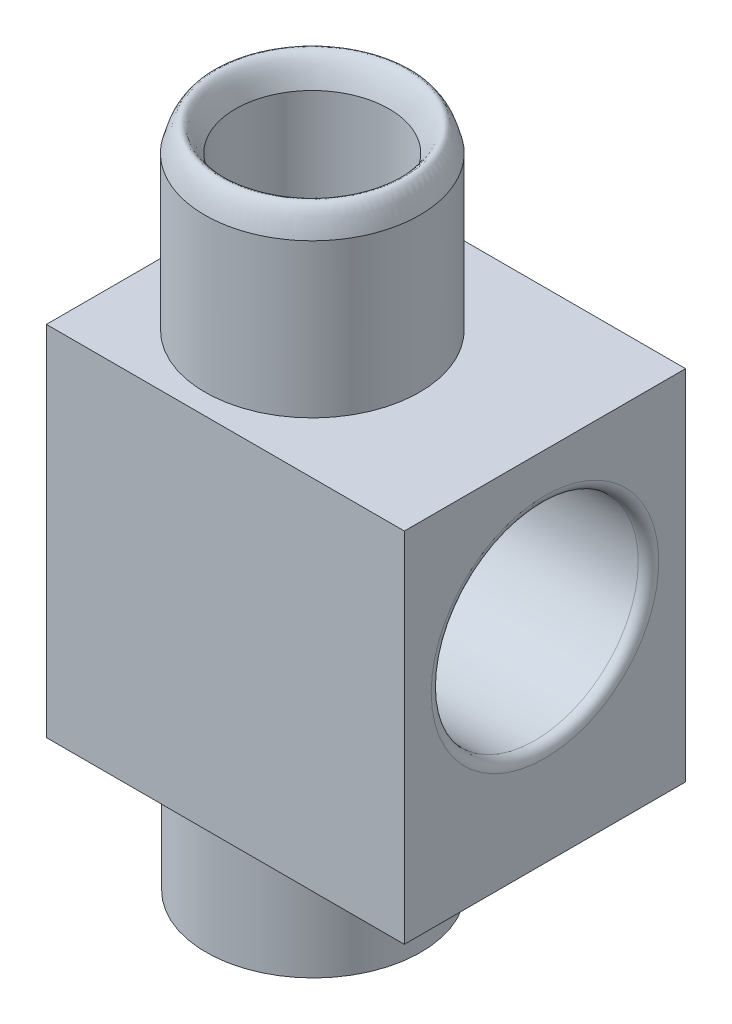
ISO-10303-21;
HEADER;
FILE_DESCRIPTION(('STEP AP214'),'2;1');
FILE_NAME('part.step','',(''),(''),'','','');
FILE_SCHEMA(('AUTOMOTIVE_DESIGN { 1 0 10303 214 1 1 1 1 }'));
ENDSEC;
DATA;
#1=APPLICATION_CONTEXT('core data for automotive mechanical design processes');
#2=APPLICATION_PROTOCOL_DEFINITION('international standard','automotive_design',2000,#1);
#3=PRODUCT_CONTEXT('',#1,'mechanical');
#4=PRODUCT('Part','Part','',(#3));
#5=PRODUCT_RELATED_PRODUCT_CATEGORY('part','',(#4));
#6=PRODUCT_DEFINITION_FORMATION('','',#4);
#7=PRODUCT_DEFINITION_CONTEXT('part definition',#1,'design');
#8=PRODUCT_DEFINITION('design','',#6,#7);
#9=PRODUCT_DEFINITION_SHAPE('','',#8);
#10=(LENGTH_UNIT() NAMED_UNIT(*) SI_UNIT(.MILLI.,.METRE.));
#11=(NAMED_UNIT(*) PLANE_ANGLE_UNIT() SI_UNIT($,.RADIAN.));
#12=(NAMED_UNIT(*) SI_UNIT($,.STERADIAN.) SOLID_ANGLE_UNIT());
#13=UNCERTAINTY_MEASURE_WITH_UNIT(LENGTH_MEASURE(1.E-05),#10,'distance_accuracy_value','');
#14=(GEOMETRIC_REPRESENTATION_CONTEXT(3) GLOBAL_UNCERTAINTY_ASSIGNED_CONTEXT((#13)) GLOBAL_UNIT_ASSIGNED_CONTEXT((#10,
#11,#12)) REPRESENTATION_CONTEXT('',''));
#15=CARTESIAN_POINT('',(0.,0.,0.));
#16=DIRECTION('',(0.,0.,1.));
#17=DIRECTION('',(1.,0.,0.));
#18=AXIS2_PLACEMENT_3D('',#15,#16,#17);
#19=CARTESIAN_POINT('',(0.,0.,-13.97));
#20=DIRECTION('',(0.,-1.,0.));
#21=DIRECTION('',(0.,0.,-1.));
#22=AXIS2_PLACEMENT_3D('',#19,#20,#21);
#23=PLANE('',#22);
#24=DIRECTION('',(0.,0.,1.));
#25=VECTOR('',#24,1.);
#26=CARTESIAN_POINT('',(0.,0.,0.));
#27=LINE('',#26,#25);
#28=CARTESIAN_POINT('',(0.,0.,-13.97));
#29=VERTEX_POINT('',#28);
#30=CARTESIAN_POINT('',(0.,0.,0.));
#31=VERTEX_POINT('',#30);
#32=EDGE_CURVE('E152',#29,#31,#27,.T.);
#33=ORIENTED_EDGE('',*,*,#32,.F.);
#34=DIRECTION('',(-1.,0.,0.));
#35=VECTOR('',#34,1.);
#36=CARTESIAN_POINT('',(0.,0.,-13.97));
#37=LINE('',#36,#35);
#38=CARTESIAN_POINT('',(17.78,0.,-13.97));
#39=VERTEX_POINT('',#38);
#40=EDGE_CURVE('E123',#39,#29,#37,.T.);
#41=ORIENTED_EDGE('',*,*,#40,.F.);
#42=DIRECTION('',(0.,0.,-1.));
#43=VECTOR('',#42,1.);
#44=CARTESIAN_POINT('',(17.78,0.,0.));
#45=LINE('',#44,#43);
#46=CARTESIAN_POINT('',(17.78,0.,0.));
#47=VERTEX_POINT('',#46);
#48=EDGE_CURVE('E117',#47,#39,#45,.T.);
#49=ORIENTED_EDGE('',*,*,#48,.F.);
#50=DIRECTION('',(1.,0.,0.));
#51=VECTOR('',#50,1.);
#52=CARTESIAN_POINT('',(0.,0.,0.));
#53=LINE('',#52,#51);
#54=EDGE_CURVE('E142',#31,#47,#53,.T.);
#55=ORIENTED_EDGE('',*,*,#54,.F.);
#56=EDGE_LOOP('',(#33,#41,#49,#55));
#57=FACE_BOUND('',#56,.T.);
#58=CARTESIAN_POINT('',(6.84958993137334,0.,-6.41337171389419));
#59=DIRECTION('',(0.,-1.,0.));
#60=DIRECTION('',(0.,0.,-1.));
#61=AXIS2_PLACEMENT_3D('',#58,#59,#60);
#62=CIRCLE('',#61,5.334);
#63=CARTESIAN_POINT('',(6.84958993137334,0.,-11.7473717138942));
#64=VERTEX_POINT('',#63);
#65=EDGE_CURVE('E250',#64,#64,#62,.T.);
#66=ORIENTED_EDGE('',*,*,#65,.F.);
#67=EDGE_LOOP('',(#66));
#68=FACE_BOUND('',#67,.T.);
#69=ADVANCED_FACE('F83',(#57,#68),#23,.T.);
#70=CARTESIAN_POINT('',(0.,17.78,-13.97));
#71=DIRECTION('',(0.,-1.,0.));
#72=DIRECTION('',(0.,0.,-1.));
#73=AXIS2_PLACEMENT_3D('',#70,#71,#72);
#74=PLANE('',#73);
#75=DIRECTION('',(0.,0.,1.));
#76=VECTOR('',#75,1.);
#77=CARTESIAN_POINT('',(0.,17.78,0.));
#78=LINE('',#77,#76);
#79=CARTESIAN_POINT('',(0.,17.78,-13.97));
#80=VERTEX_POINT('',#79);
#81=CARTESIAN_POINT('',(0.,17.78,0.));
#82=VERTEX_POINT('',#81);
#83=EDGE_CURVE('E137',#80,#82,#78,.T.);
#84=ORIENTED_EDGE('',*,*,#83,.T.);
#85=DIRECTION('',(1.,0.,0.));
#86=VECTOR('',#85,1.);
#87=CARTESIAN_POINT('',(0.,17.78,0.));
#88=LINE('',#87,#86);
#89=CARTESIAN_POINT('',(17.78,17.78,0.));
#90=VERTEX_POINT('',#89);
#91=EDGE_CURVE('E131',#82,#90,#88,.T.);
#92=ORIENTED_EDGE('',*,*,#91,.T.);
#93=DIRECTION('',(0.,0.,-1.));
#94=VECTOR('',#93,1.);
#95=CARTESIAN_POINT('',(17.78,17.78,0.));
#96=LINE('',#95,#94);
#97=CARTESIAN_POINT('',(17.78,17.78,-13.97));
#98=VERTEX_POINT('',#97);
#99=EDGE_CURVE('E135',#90,#98,#96,.T.);
#100=ORIENTED_EDGE('',*,*,#99,.T.);
#101=DIRECTION('',(-1.,0.,0.));
#102=VECTOR('',#101,1.);
#103=CARTESIAN_POINT('',(0.,17.78,-13.97));
#104=LINE('',#103,#102);
#105=EDGE_CURVE('E100',#98,#80,#104,.T.);
#106=ORIENTED_EDGE('',*,*,#105,.T.);
#107=EDGE_LOOP('',(#84,#92,#100,#106));
#108=FACE_BOUND('',#107,.T.);
#109=CARTESIAN_POINT('',(6.858,17.78,-6.35));
#110=DIRECTION('',(0.,-1.,0.));
#111=DIRECTION('',(0.,0.,-1.));
#112=AXIS2_PLACEMENT_3D('',#109,#110,#111);
#113=CIRCLE('',#112,5.334);
#114=CARTESIAN_POINT('',(6.858,17.78,-11.684));
#115=VERTEX_POINT('',#114);
#116=EDGE_CURVE('E162',#115,#115,#113,.F.);
#117=ORIENTED_EDGE('',*,*,#116,.F.);
#118=EDGE_LOOP('',(#117));
#119=FACE_BOUND('',#118,.T.);
#120=ADVANCED_FACE('F132',(#108,#119),#74,.F.);
#121=CARTESIAN_POINT('',(0.,17.78,0.));
#122=DIRECTION('',(1.,0.,0.));
#123=DIRECTION('',(0.,0.,-1.));
#124=AXIS2_PLACEMENT_3D('',#121,#122,#123);
#125=PLANE('',#124);
#126=ORIENTED_EDGE('',*,*,#32,.T.);
#127=DIRECTION('',(0.,-1.,0.));
#128=VECTOR('',#127,1.);
#129=CARTESIAN_POINT('',(0.,17.78,0.));
#130=LINE('',#129,#128);
#131=EDGE_CURVE('E143',#82,#31,#130,.T.);
#132=ORIENTED_EDGE('',*,*,#131,.F.);
#133=ORIENTED_EDGE('',*,*,#83,.F.);
#134=DIRECTION('',(0.,-1.,0.));
#135=VECTOR('',#134,1.);
#136=CARTESIAN_POINT('',(0.,17.78,-13.97));
#137=LINE('',#136,#135);
#138=EDGE_CURVE('E148',#80,#29,#137,.T.);
#139=ORIENTED_EDGE('',*,*,#138,.T.);
#140=EDGE_LOOP('',(#126,#132,#133,#139));
#141=FACE_BOUND('',#140,.T.);
#142=ADVANCED_FACE('F209',(#141),#125,.F.);
#143=CARTESIAN_POINT('',(0.,17.78,0.));
#144=DIRECTION('',(0.,0.,-1.));
#145=DIRECTION('',(-1.,0.,0.));
#146=AXIS2_PLACEMENT_3D('',#143,#144,#145);
#147=PLANE('',#146);
#148=ORIENTED_EDGE('',*,*,#54,.T.);
#149=DIRECTION('',(0.,-1.,0.));
#150=VECTOR('',#149,1.);
#151=CARTESIAN_POINT('',(17.78,17.78,0.));
#152=LINE('',#151,#150);
#153=EDGE_CURVE('E140',#90,#47,#152,.T.);
#154=ORIENTED_EDGE('',*,*,#153,.F.);
#155=ORIENTED_EDGE('',*,*,#91,.F.);
#156=ORIENTED_EDGE('',*,*,#131,.T.);
#157=EDGE_LOOP('',(#148,#154,#155,#156));
#158=FACE_BOUND('',#157,.T.);
#159=ADVANCED_FACE('F141',(#158),#147,.F.);
#160=CARTESIAN_POINT('',(17.78,17.78,0.));
#161=DIRECTION('',(-1.,0.,0.));
#162=DIRECTION('',(0.,0.,1.));
#163=AXIS2_PLACEMENT_3D('',#160,#161,#162);
#164=PLANE('',#163);
#165=CARTESIAN_POINT('',(17.78,10.16,-6.985));
#166=DIRECTION('',(-1.,0.,0.));
#167=DIRECTION('',(0.,0.,1.));
#168=AXIS2_PLACEMENT_3D('',#165,#166,#167);
#169=CIRCLE('',#168,5.6515);
#170=CARTESIAN_POINT('',(17.78,10.16,-1.3335));
#171=VERTEX_POINT('',#170);
#172=EDGE_CURVE('E14',#171,#171,#169,.T.);
#173=ORIENTED_EDGE('',*,*,#172,.T.);
#174=EDGE_LOOP('',(#173));
#175=FACE_BOUND('',#174,.T.);
#176=ORIENTED_EDGE('',*,*,#48,.T.);
#177=DIRECTION('',(0.,-1.,0.));
#178=VECTOR('',#177,1.);
#179=CARTESIAN_POINT('',(17.78,17.78,-13.97));
#180=LINE('',#179,#178);
#181=EDGE_CURVE('E144',#98,#39,#180,.T.);
#182=ORIENTED_EDGE('',*,*,#181,.F.);
#183=ORIENTED_EDGE('',*,*,#99,.F.);
#184=ORIENTED_EDGE('',*,*,#153,.T.);
#185=EDGE_LOOP('',(#176,#182,#183,#184));
#186=FACE_BOUND('',#185,.T.);
#187=ADVANCED_FACE('F146',(#175,#186),#164,.F.);
#188=CARTESIAN_POINT('',(0.,17.78,-13.97));
#189=DIRECTION('',(0.,0.,1.));
#190=DIRECTION('',(1.,0.,0.));
#191=AXIS2_PLACEMENT_3D('',#188,#189,#190);
#192=PLANE('',#191);
#193=ORIENTED_EDGE('',*,*,#40,.T.);
#194=ORIENTED_EDGE('',*,*,#138,.F.);
#195=ORIENTED_EDGE('',*,*,#105,.F.);
#196=ORIENTED_EDGE('',*,*,#181,.T.);
#197=EDGE_LOOP('',(#193,#194,#195,#196));
#198=FACE_BOUND('',#197,.T.);
#199=ADVANCED_FACE('F236',(#198),#192,.F.);
#200=CARTESIAN_POINT('',(6.858,25.4,-6.35));
#201=DIRECTION('',(0.,-1.,0.));
#202=DIRECTION('',(0.,0.,-1.));
#203=AXIS2_PLACEMENT_3D('',#200,#201,#202);
#204=CYLINDRICAL_SURFACE('',#203,5.334);
#205=CARTESIAN_POINT('',(6.85800000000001,25.3999979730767,-1.01600793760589));
#206=CARTESIAN_POINT('',(6.94538554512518,25.3999828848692,-1.01600219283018));
#207=CARTESIAN_POINT('',(7.03277230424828,25.3999267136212,-1.01813716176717));
#208=CARTESIAN_POINT('',(7.2071225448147,25.3998209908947,-1.02668726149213));
#209=CARTESIAN_POINT('',(7.29408653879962,25.3997714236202,-1.03309195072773));
#210=CARTESIAN_POINT('',(7.46759150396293,25.399766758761,-1.05017994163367));
#211=CARTESIAN_POINT('',(7.55413248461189,25.3998116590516,-1.06086314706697));
#212=CARTESIAN_POINT('',(7.72679170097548,25.3999283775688,-1.08649511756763));
#213=CARTESIAN_POINT('',(7.81290842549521,25.4000002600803,-1.1014540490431));
#214=CARTESIAN_POINT('',(7.98430797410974,25.3999948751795,-1.13554658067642));
#215=CARTESIAN_POINT('',(8.06959083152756,25.399917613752,-1.15468001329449));
#216=CARTESIAN_POINT('',(8.23891159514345,25.3997962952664,-1.19707122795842));
#217=CARTESIAN_POINT('',(8.32295196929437,25.3997521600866,-1.22031914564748));
#218=CARTESIAN_POINT('',(8.48978921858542,25.399755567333,-1.2709290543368));
#219=CARTESIAN_POINT('',(8.57258603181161,25.3998031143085,-1.29829124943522));
#220=CARTESIAN_POINT('',(8.73693883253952,25.3999247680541,-1.35711912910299));
#221=CARTESIAN_POINT('',(8.81849124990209,25.3999989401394,-1.38859478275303));
#222=CARTESIAN_POINT('',(8.97995534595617,25.3999952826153,-1.4554744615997));
#223=CARTESIAN_POINT('',(9.05986725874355,25.3999174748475,-1.49087792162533));
#224=CARTESIAN_POINT('',(9.21766514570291,25.399795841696,-1.56548714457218));
#225=CARTESIAN_POINT('',(9.2955554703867,25.3997519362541,-1.6046837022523));
#226=CARTESIAN_POINT('',(9.44931369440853,25.3997556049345,-1.68686908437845));
#227=CARTESIAN_POINT('',(9.52518149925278,25.3998031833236,-1.72985808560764));
#228=CARTESIAN_POINT('',(9.67489934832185,25.3999249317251,-1.81961855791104));
#229=CARTESIAN_POINT('',(9.7487439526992,25.3999991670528,-1.86639909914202));
#230=CARTESIAN_POINT('',(9.89405791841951,25.3999956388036,-1.96349325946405));
#231=CARTESIAN_POINT('',(9.96552760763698,25.3999178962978,-2.01380638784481));
#232=CARTESIAN_POINT('',(10.105738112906,25.3997963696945,-2.11776671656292));
#233=CARTESIAN_POINT('',(10.174484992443,25.3997525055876,-2.17140573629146));
#234=CARTESIAN_POINT('',(10.3092552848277,25.3997561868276,-2.28200868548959));
#235=CARTESIAN_POINT('',(10.3752785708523,25.3998037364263,-2.33897276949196));
#236=CARTESIAN_POINT('',(10.504608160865,25.3999253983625,-2.45621715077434));
#237=CARTESIAN_POINT('',(10.5679073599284,25.3999995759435,-2.51650528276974));
#238=CARTESIAN_POINT('',(10.6914865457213,25.3999959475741,-2.64008313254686));
#239=CARTESIAN_POINT('',(10.7517669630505,25.3999181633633,-2.70337241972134));
#240=CARTESIAN_POINT('',(10.8690010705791,25.399796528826,-2.83268880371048));
#241=CARTESIAN_POINT('',(10.9259622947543,25.399752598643,-2.8987090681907));
#242=CARTESIAN_POINT('',(11.0365651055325,25.399756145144,-3.03347947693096));
#243=CARTESIAN_POINT('',(11.090206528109,25.3998036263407,-3.10222975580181));
#244=CARTESIAN_POINT('',(11.1941777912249,25.3999251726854,-3.24245293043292));
#245=CARTESIAN_POINT('',(11.2444991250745,25.3999993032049,-3.31393213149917));
#246=CARTESIAN_POINT('',(11.3415948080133,25.3999955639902,-3.45924504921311));
#247=CARTESIAN_POINT('',(11.3883696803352,25.3999177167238,-3.53307841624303));
#248=CARTESIAN_POINT('',(11.4781225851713,25.3997959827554,-3.6827813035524));
#249=CARTESIAN_POINT('',(11.5211093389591,25.3997520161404,-3.75864559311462));
#250=CARTESIAN_POINT('',(11.6032945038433,25.3997555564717,-3.91240393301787));
#251=CARTESIAN_POINT('',(11.6424927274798,25.399803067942,-3.99029808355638));
#252=CARTESIAN_POINT('',(11.7171101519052,25.3999247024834,-4.14811059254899));
#253=CARTESIAN_POINT('',(11.7525197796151,25.3999988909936,-4.22803347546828));
#254=CARTESIAN_POINT('',(11.8194010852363,25.3999952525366,-4.38949686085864));
#255=CARTESIAN_POINT('',(11.8508733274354,25.399917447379,-4.47103712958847));
#256=CARTESIAN_POINT('',(11.9096966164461,25.3997958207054,-4.63537375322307));
#257=CARTESIAN_POINT('',(11.9370572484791,25.3997519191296,-4.71816667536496));
#258=CARTESIAN_POINT('',(11.9876668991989,25.3997555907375,-4.88500399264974));
#259=CARTESIAN_POINT('',(12.0109157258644,25.3998031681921,-4.96904844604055));
#260=CARTESIAN_POINT('',(12.0533119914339,25.3999249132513,-5.1383851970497));
#261=CARTESIAN_POINT('',(12.0724491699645,25.399999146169,-5.22368006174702));
#262=CARTESIAN_POINT('',(12.1065457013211,25.3999956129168,-5.39508847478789));
#263=CARTESIAN_POINT('',(12.1215056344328,25.3999178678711,-5.48120190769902));
#264=CARTESIAN_POINT('',(12.1471383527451,25.3997963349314,-5.65385672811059));
#265=CARTESIAN_POINT('',(12.1578212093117,25.3997524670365,-5.74039661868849));
#266=CARTESIAN_POINT('',(12.1749100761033,25.3997561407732,-5.91390169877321));
#267=CARTESIAN_POINT('',(12.1813158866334,25.3998036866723,-6.00086690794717));
#268=CARTESIAN_POINT('',(12.1898613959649,25.3999253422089,-6.17522106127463));
#269=CARTESIAN_POINT('',(12.1919905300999,25.3999995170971,-6.26261052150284));
#270=CARTESIAN_POINT('',(12.1919914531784,25.3999958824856,-6.43737694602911));
#271=CARTESIAN_POINT('',(12.1898638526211,25.3999180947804,-6.52475391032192));
#272=CARTESIAN_POINT('',(12.1813203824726,25.3997964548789,-6.6990914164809));
#273=CARTESIAN_POINT('',(12.1749146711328,25.3997525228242,-6.78605245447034));
#274=CARTESIAN_POINT('',(12.157825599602,25.3997560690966,-6.9595575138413));
#275=CARTESIAN_POINT('',(12.1471420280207,25.3998035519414,-7.04610151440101));
#276=CARTESIAN_POINT('',(12.1215080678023,25.3999251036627,-7.21877305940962));
#277=CARTESIAN_POINT('',(12.1065472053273,25.399999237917,-7.30489904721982));
#278=CARTESIAN_POINT('',(12.0724524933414,25.3999955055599,-7.47630783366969));
#279=CARTESIAN_POINT('',(12.0533192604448,25.3999176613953,-7.56159075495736));
#280=CARTESIAN_POINT('',(12.0109282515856,25.3997959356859,-7.73091159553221));
#281=CARTESIAN_POINT('',(11.9876803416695,25.3997519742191,-7.81495198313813));
#282=CARTESIAN_POINT('',(11.9370705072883,25.3997555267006,-7.9817892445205));
#283=CARTESIAN_POINT('',(11.9097083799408,25.3998030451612,-8.06458605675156));
#284=CARTESIAN_POINT('',(11.8508806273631,25.3999246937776,-8.22893883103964));
#285=CARTESIAN_POINT('',(11.8194050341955,25.3999988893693,-8.3104912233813));
#286=CARTESIAN_POINT('',(11.7525254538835,25.3999952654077,-8.47195532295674));
#287=CARTESIAN_POINT('',(11.717122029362,25.3999174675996,-8.55186726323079));
#288=CARTESIAN_POINT('',(11.642512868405,25.3997958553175,-8.70966519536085));
#289=CARTESIAN_POINT('',(11.6033163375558,25.3997519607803,-8.78755553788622));
#290=CARTESIAN_POINT('',(11.5211310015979,25.3997556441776,-8.94131378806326));
#291=CARTESIAN_POINT('',(11.4781420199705,25.3998032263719,-9.01718160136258));
#292=CARTESIAN_POINT('',(11.3883815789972,25.3999249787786,-9.1668994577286));
#293=CARTESIAN_POINT('',(11.3416010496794,25.3999992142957,-9.24074406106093));
#294=CARTESIAN_POINT('',(11.2445069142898,25.3999956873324,-9.38605800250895));
#295=CARTESIAN_POINT('',(11.1941937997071,25.3999179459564,-9.4575276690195));
#296=CARTESIAN_POINT('',(11.0902334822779,25.3997964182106,-9.59773813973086));
#297=CARTESIAN_POINT('',(11.0365944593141,25.3997525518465,-9.66648500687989));
#298=CARTESIAN_POINT('',(10.9259914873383,25.3997562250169,-9.80125528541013));
#299=CARTESIAN_POINT('',(10.869027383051,25.3998037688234,-9.86727856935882));
#300=CARTESIAN_POINT('',(10.7517829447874,25.3999254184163,-9.99660816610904));
#301=CARTESIAN_POINT('',(10.6914947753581,25.3999995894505,-10.0599073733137));
#302=CARTESIAN_POINT('',(10.5679168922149,25.3999959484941,-10.1834865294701));
#303=CARTESIAN_POINT('',(10.5046276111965,25.3999181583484,-10.2437669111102));
#304=CARTESIAN_POINT('',(10.3753112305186,25.3997965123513,-10.3610009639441));
#305=CARTESIAN_POINT('',(10.3092909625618,25.3997525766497,-10.4179621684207));
#306=CARTESIAN_POINT('',(10.1745205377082,25.3997561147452,-10.5285649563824));
#307=CARTESIAN_POINT('',(10.1057702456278,25.3998035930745,-10.5822063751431));
#308=CARTESIAN_POINT('',(9.96554703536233,25.3999251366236,-10.6861776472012));
#309=CARTESIAN_POINT('',(9.89406781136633,25.3999992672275,-10.7364989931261));
#310=CARTESIAN_POINT('',(9.74875486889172,25.3999955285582,-10.8335946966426));
#311=CARTESIAN_POINT('',(9.67492150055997,25.3999176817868,-10.8803695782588));
#312=CARTESIAN_POINT('',(9.52521861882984,25.3997959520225,-10.9701225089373));
#313=CARTESIAN_POINT('',(9.449354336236,25.3997519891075,-11.0131092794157));
#314=CARTESIAN_POINT('',(9.29559601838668,25.3997555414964,-11.0952944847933));
#315=CARTESIAN_POINT('',(9.21770188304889,25.3998030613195,-11.1344927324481));
#316=CARTESIAN_POINT('',(9.05988941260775,25.39992471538,-11.2091102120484));
#317=CARTESIAN_POINT('',(8.97996655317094,25.3999989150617,-11.2445198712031));
#318=CARTESIAN_POINT('',(8.81850317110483,25.3999952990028,-11.3114012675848));
#319=CARTESIAN_POINT('',(8.73696288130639,25.3999175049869,-11.3428735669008));
#320=CARTESIAN_POINT('',(8.57262623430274,25.3997959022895,-11.4016969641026));
#321=CARTESIAN_POINT('',(8.48983331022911,25.3997520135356,-11.4290576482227));
#322=CARTESIAN_POINT('',(8.32299600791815,25.3997557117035,-11.4796673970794));
#323=CARTESIAN_POINT('',(8.23895157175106,25.3998033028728,-11.502916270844));
#324=CARTESIAN_POINT('',(8.06961487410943,25.399925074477,-11.5453126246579));
#325=CARTESIAN_POINT('',(7.98432004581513,25.399999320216,-11.5644498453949));
#326=CARTESIAN_POINT('',(7.81291163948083,25.3999958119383,-11.5985464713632));
#327=CARTESIAN_POINT('',(7.72679817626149,25.3999180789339,-11.6135064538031));
#328=CARTESIAN_POINT('',(7.55414330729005,25.3997965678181,-11.6391392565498));
#329=CARTESIAN_POINT('',(7.46760339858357,25.3997527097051,-11.6498221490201));
#330=CARTESIAN_POINT('',(7.2940982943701,25.3997563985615,-11.6669110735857));
#331=CARTESIAN_POINT('',(7.20713307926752,25.3998039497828,-11.6733169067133));
#332=CARTESIAN_POINT('',(7.03277892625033,25.3999256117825,-11.6818624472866));
#333=CARTESIAN_POINT('',(6.94538947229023,25.3999997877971,-11.6839915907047));
#334=CARTESIAN_POINT('',(6.77062305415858,25.3999961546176,-11.6839925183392));
#335=CARTESIAN_POINT('',(6.68324608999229,25.3999183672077,-11.6818649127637));
#336=CARTESIAN_POINT('',(6.50890857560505,25.3997967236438,-11.6733214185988));
#337=CARTESIAN_POINT('',(6.42194752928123,25.3997527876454,-11.6669156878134));
#338=CARTESIAN_POINT('',(6.24844244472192,25.39975632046,-11.6498265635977));
#339=CARTESIAN_POINT('',(6.16189842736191,25.3998037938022,-11.6391429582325));
#340=CARTESIAN_POINT('',(5.98922684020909,25.3999253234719,-11.61350891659));
#341=CARTESIAN_POINT('',(5.90310082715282,25.3999994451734,-11.5985480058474));
#342=CARTESIAN_POINT('',(5.73169205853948,25.399995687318,-11.564453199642));
#343=CARTESIAN_POINT('',(5.64640917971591,25.3999178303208,-11.5453199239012));
#344=CARTESIAN_POINT('',(5.47708840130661,25.3997960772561,-11.5029288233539));
#345=CARTESIAN_POINT('',(5.39304803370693,25.3997521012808,-11.4796808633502));
#346=CARTESIAN_POINT('',(5.22621078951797,25.3997556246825,-11.429070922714));
#347=CARTESIAN_POINT('',(5.14341397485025,25.3998031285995,-11.4017087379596));
#348=CARTESIAN_POINT('',(4.97906117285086,25.3999247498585,-11.3428808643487));
#349=CARTESIAN_POINT('',(4.8975087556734,25.3999989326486,-11.3114052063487));
#350=CARTESIAN_POINT('',(4.73604466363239,25.3999952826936,-11.2445255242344));
#351=CARTESIAN_POINT('',(4.65613275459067,25.3999174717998,-11.2091220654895));
#352=CARTESIAN_POINT('',(4.49833487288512,25.3997958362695,-11.1345128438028));
#353=CARTESIAN_POINT('',(4.42044454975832,25.3997519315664,-11.0953162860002));
#354=CARTESIAN_POINT('',(4.26668632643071,25.3997556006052,-11.0131309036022));
#355=CARTESIAN_POINT('',(4.19081852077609,25.399803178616,-10.9701419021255));
#356=CARTESIAN_POINT('',(4.04110066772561,25.3999249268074,-10.8803814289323));
#357=CARTESIAN_POINT('',(3.96725606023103,25.3999991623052,-10.8336008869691));
#358=CARTESIAN_POINT('',(3.82194208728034,25.3999956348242,-10.7365067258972));
#359=CARTESIAN_POINT('',(3.75047239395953,25.3999178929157,-10.6861935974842));
#360=CARTESIAN_POINT('',(3.6102618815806,25.3997963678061,-10.5822332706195));
#361=CARTESIAN_POINT('',(3.54151499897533,25.3997525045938,-10.5285942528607));
#362=CARTESIAN_POINT('',(3.40674470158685,25.3997561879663,-10.4179913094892));
#363=CARTESIAN_POINT('',(3.34072141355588,25.3998037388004,-10.3610272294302));
#364=CARTESIAN_POINT('',(3.21139182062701,25.3999254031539,-10.2437828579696));
#365=CARTESIAN_POINT('',(3.14809262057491,25.3999995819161,-10.1834947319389));
#366=CARTESIAN_POINT('',(3.02451342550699,25.399995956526,-10.0599168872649));
#367=CARTESIAN_POINT('',(2.96423300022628,25.3999181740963,-9.99662759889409));
#368=CARTESIAN_POINT('',(2.84699888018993,25.3997965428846,-9.86731121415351));
#369=CARTESIAN_POINT('',(2.79003765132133,25.3997526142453,-9.80129095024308));
#370=CARTESIAN_POINT('',(2.67943483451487,25.3997561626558,-9.66652054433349));
#371=CARTESIAN_POINT('',(2.62579341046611,25.3998036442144,-9.59777026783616));
#372=CARTESIAN_POINT('',(2.52182214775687,25.3999251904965,-9.45754709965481));
#373=CARTESIAN_POINT('',(2.4715008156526,25.3999993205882,-9.3860679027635));
#374=CARTESIAN_POINT('',(2.37440513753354,25.3999955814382,-9.24075499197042));
#375=CARTESIAN_POINT('',(2.3276302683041,25.3999177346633,-9.16692162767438));
#376=CARTESIAN_POINT('',(2.23787736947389,25.3997960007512,-9.01721874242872));
#377=CARTESIAN_POINT('',(2.19489061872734,25.3997520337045,-8.94135445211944));
#378=CARTESIAN_POINT('',(2.11270545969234,25.3997555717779,-8.78759610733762));
#379=CARTESIAN_POINT('',(2.07350723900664,25.3998030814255,-8.70970195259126));
#380=CARTESIAN_POINT('',(1.99888982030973,25.3999247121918,-8.55188943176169));
#381=CARTESIAN_POINT('',(1.96348019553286,25.3999988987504,-8.47196654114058));
#382=CARTESIAN_POINT('',(1.89659890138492,25.3999952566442,-8.31050315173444));
#383=CARTESIAN_POINT('',(1.8651266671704,25.3999174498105,-8.22896288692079));
#384=CARTESIAN_POINT('',(1.80630339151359,25.3997958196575,-8.06462626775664));
#385=CARTESIAN_POINT('',(1.77894276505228,25.3997519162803,-7.98183334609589));
#386=CARTESIAN_POINT('',(1.72833312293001,25.3997555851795,-7.8149960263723));
#387=CARTESIAN_POINT('',(1.7050842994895,25.3998031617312,-7.73095157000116));
#388=CARTESIAN_POINT('',(1.66268803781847,25.3999249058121,-7.56161480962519));
#389=CARTESIAN_POINT('',(1.64355086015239,25.3999991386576,-7.47631993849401));
#390=CARTESIAN_POINT('',(1.60945432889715,25.3999956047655,-7.30491151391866));
#391=CARTESIAN_POINT('',(1.59449439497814,25.3999178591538,-7.21879807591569));
#392=CARTESIAN_POINT('',(1.56886167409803,25.3997963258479,-7.04614324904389));
#393=CARTESIAN_POINT('',(1.55817881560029,25.3997524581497,-6.95960335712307));
#394=CARTESIAN_POINT('',(1.5410899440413,25.3997561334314,-6.78609827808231));
#395=CARTESIAN_POINT('',(1.53468413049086,25.3998036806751,-6.69913307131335));
#396=CARTESIAN_POINT('',(1.52613861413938,25.3999253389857,-6.52477892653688));
#397=CARTESIAN_POINT('',(1.52400947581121,25.3999995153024,-6.43738947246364));
#398=CARTESIAN_POINT('',(1.52400854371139,25.3999958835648,-6.26262304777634));
#399=CARTESIAN_POINT('',(1.52613614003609,25.3999180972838,-6.17524607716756));
#400=CARTESIAN_POINT('',(1.53467960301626,25.399796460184,-6.00090856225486));
#401=CARTESIAN_POINT('',(1.54108531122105,25.3997525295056,-5.91394752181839));
#402=CARTESIAN_POINT('',(1.55817437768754,25.3997560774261,-5.7404424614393));
#403=CARTESIAN_POINT('',(1.56885794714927,25.3998035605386,-5.65389846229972));
#404=CARTESIAN_POINT('',(1.59449190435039,25.3999251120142,-5.48122692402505));
#405=CARTESIAN_POINT('',(1.6094527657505,25.3999992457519,-5.39510094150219));
#406=CARTESIAN_POINT('',(1.64354747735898,25.3999955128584,-5.22369216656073));
#407=CARTESIAN_POINT('',(1.66268071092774,25.3999176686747,-5.13840925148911));
#408=CARTESIAN_POINT('',(1.70507172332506,25.3997959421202,-4.96908841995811));
#409=CARTESIAN_POINT('',(1.72831963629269,25.3997519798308,-4.88504803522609));
#410=CARTESIAN_POINT('',(1.77892947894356,25.3997555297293,-4.71821077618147));
#411=CARTESIAN_POINT('',(1.80629161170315,25.399803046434,-4.63541396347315));
#412=CARTESIAN_POINT('',(1.86511937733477,25.3999246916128,-4.47106118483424));
#413=CARTESIAN_POINT('',(1.89659497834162,25.3999988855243,-4.38950878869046));
#414=CARTESIAN_POINT('',(1.96347456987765,25.3999952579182,-4.22804469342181));
#415=CARTESIAN_POINT('',(1.99887799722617,25.3999174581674,-4.14813276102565));
#416=CARTESIAN_POINT('',(2.07348716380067,25.3997958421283,-3.99033484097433));
#417=CARTESIAN_POINT('',(2.1126836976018,25.3997519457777,-3.91244450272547));
#418=CARTESIAN_POINT('',(2.19486903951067,25.3997556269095,-3.7586862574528));
#419=CARTESIAN_POINT('',(2.23785802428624,25.3998032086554,-3.68281844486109));
#420=CARTESIAN_POINT('',(2.32761847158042,25.3999249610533,-3.5331005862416));
#421=CARTESIAN_POINT('',(2.37439900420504,25.3999991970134,-3.45925598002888));
#422=CARTESIAN_POINT('',(2.47149314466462,25.399995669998,-3.31394203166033));
#423=CARTESIAN_POINT('',(2.52180626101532,25.3999179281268,-3.24247236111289));
#424=CARTESIAN_POINT('',(2.62576657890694,25.399796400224,-3.102261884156));
#425=CARTESIAN_POINT('',(2.67940560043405,25.3997525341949,-3.0335150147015));
#426=CARTESIAN_POINT('',(2.79000856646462,25.3997562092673,-2.89874473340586));
#427=CARTESIAN_POINT('',(2.84697266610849,25.3998037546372,-2.83272144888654));
#428=CARTESIAN_POINT('',(2.96421709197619,25.3999254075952,-2.70339185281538));
#429=CARTESIAN_POINT('',(3.02450525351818,25.3999995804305,-2.6400926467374));
#430=CARTESIAN_POINT('',(3.14808312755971,25.3999959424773,-2.51651348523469));
#431=CARTESIAN_POINT('',(3.21137240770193,25.3999181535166,-2.45623309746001));
#432=CARTESIAN_POINT('',(3.34068878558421,25.3997965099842,-2.33899903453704));
#433=CARTESIAN_POINT('',(3.40670905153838,25.399752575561,-2.28203782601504));
#434=CARTESIAN_POINT('',(3.5414794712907,25.3997561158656,-2.17143503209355));
#435=CARTESIAN_POINT('',(3.61022976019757,25.3998035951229,-2.11779361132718));
#436=CARTESIAN_POINT('',(3.75045296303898,25.3999251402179,-2.01382233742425));
#437=CARTESIAN_POINT('',(3.82193218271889,25.399999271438,-1.9635009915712));
#438=CARTESIAN_POINT('',(3.96724511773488,25.3999955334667,-1.86640528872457));
#439=CARTESIAN_POINT('',(4.04107848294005,25.3999176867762,-1.81963040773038));
#440=CARTESIAN_POINT('',(4.19078136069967,25.3997959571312,-1.72987747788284));
#441=CARTESIAN_POINT('',(4.26664564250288,25.3997519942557,-1.68689070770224));
#442=CARTESIAN_POINT('',(4.42040396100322,25.3997555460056,-1.60470550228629));
#443=CARTESIAN_POINT('',(4.49829809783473,25.3998030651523,-1.56550725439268));
#444=CARTESIAN_POINT('',(4.65611057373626,25.3999247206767,-1.49088977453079));
#445=CARTESIAN_POINT('',(4.73603343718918,25.3999989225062,-1.45548011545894));
#446=CARTESIAN_POINT('',(4.89749682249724,25.3999952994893,-1.38859871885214));
#447=CARTESIAN_POINT('',(4.97903711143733,25.399917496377,-1.35712641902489));
#448=CARTESIAN_POINT('',(5.14337375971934,25.3997959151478,-1.29830302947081));
#449=CARTESIAN_POINT('',(5.22616668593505,25.3997520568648,-1.27094235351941));
#450=CARTESIAN_POINT('',(5.39300398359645,25.3997556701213,-1.22033258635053));
#451=CARTESIAN_POINT('',(5.4770484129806,25.3998031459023,-1.1970836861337));
#452=CARTESIAN_POINT('',(5.6463851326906,25.3999252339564,-1.15468740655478));
#453=CARTESIAN_POINT('',(5.73167998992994,25.3999999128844,-1.13555028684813));
#454=CARTESIAN_POINT('',(5.90309760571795,25.3999952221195,-1.10145153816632));
#455=CARTESIAN_POINT('',(5.98922033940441,25.3999158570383,-1.08648978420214));
#456=CARTESIAN_POINT('',(6.16188763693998,25.399787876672,-1.0608543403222));
#457=CARTESIAN_POINT('',(6.24843065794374,25.3997391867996,-1.05017027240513));
#458=CARTESIAN_POINT('',(6.42193567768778,25.3997408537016,-1.03308233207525));
#459=CARTESIAN_POINT('',(6.50889766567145,25.3997912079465,-1.02667835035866));
#460=CARTESIAN_POINT('',(6.68323985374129,25.3999057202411,-1.01813150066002));
#461=CARTESIAN_POINT('',(6.77062055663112,25.3999699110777,-1.01599887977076));
#462=CARTESIAN_POINT('',(6.85800000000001,25.3999979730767,-1.01600793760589));
#463=B_SPLINE_CURVE_WITH_KNOTS('',3,(#205,#206,#207,#208,#209,#210,#211,#212,#213,#214,#215,
#216,#217,#218,#219,#220,#221,#222,#223,#224,#225,#226,#227,#228,#229,#230,#231,#232,#233,#234,
#235,#236,#237,#238,#239,#240,#241,#242,#243,#244,#245,#246,#247,#248,#249,#250,#251,#252,#253,
#254,#255,#256,#257,#258,#259,#260,#261,#262,#263,#264,#265,#266,#267,#268,#269,#270,#271,#272,
#273,#274,#275,#276,#277,#278,#279,#280,#281,#282,#283,#284,#285,#286,#287,#288,#289,#290,#291,
#292,#293,#294,#295,#296,#297,#298,#299,#300,#301,#302,#303,#304,#305,#306,#307,#308,#309,#310,
#311,#312,#313,#314,#315,#316,#317,#318,#319,#320,#321,#322,#323,#324,#325,#326,#327,#328,#329,
#330,#331,#332,#333,#334,#335,#336,#337,#338,#339,#340,#341,#342,#343,#344,#345,#346,#347,#348,
#349,#350,#351,#352,#353,#354,#355,#356,#357,#358,#359,#360,#361,#362,#363,#364,#365,#366,#367,
#368,#369,#370,#371,#372,#373,#374,#375,#376,#377,#378,#379,#380,#381,#382,#383,#384,#385,#386,
#387,#388,#389,#390,#391,#392,#393,#394,#395,#396,#397,#398,#399,#400,#401,#402,#403,#404,#405,
#406,#407,#408,#409,#410,#411,#412,#413,#414,#415,#416,#417,#418,#419,#420,#421,#422,#423,#424,
#425,#426,#427,#428,#429,#430,#431,#432,#433,#434,#435,#436,#437,#438,#439,#440,#441,#442,#443,
#444,#445,#446,#447,#448,#449,#450,#451,#452,#453,#454,#455,#456,#457,#458,#459,#460,#461,#462),
.UNSPECIFIED.,.F.,.F.,(4,2,2,2,2,2,2,2,2,2,2,2,2,2,2,2,2,2,2,2,2,2,2,2,2,2,2,2,2,2,2,2,2,2,2,2,
2,2,2,2,2,2,2,2,2,2,2,2,2,2,2,2,2,2,2,2,2,2,2,2,2,2,2,2,2,2,2,2,2,2,2,2,2,2,2,2,2,2,2,2,2,2,2,2,
2,2,2,2,2,2,2,2,2,2,2,2,2,2,2,2,2,2,2,2,2,2,2,2,2,2,2,2,2,2,2,2,2,2,2,2,2,2,2,2,2,2,2,2,4),(0.,
0.262132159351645,0.523625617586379,0.785113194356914,1.04722775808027,1.30933180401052,
1.57081577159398,1.83231271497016,2.09445558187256,2.35656077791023,2.61804511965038,
2.87954165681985,3.14168333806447,3.40378867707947,3.66527310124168,3.92676968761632,
4.18891141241,4.45101563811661,4.71249969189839,4.973996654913,5.23613950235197,
5.49824359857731,5.75972757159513,6.02122447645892,6.28336726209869,6.54547243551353,
6.80695676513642,7.06845330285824,7.33059499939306,7.59270026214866,7.85418465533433,
8.11568125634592,8.3778230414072,8.63992723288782,8.9014112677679,9.1629082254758,
9.42505107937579,9.6871552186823,9.94863920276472,10.2101360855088,10.4722788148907,
10.7343840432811,10.9958683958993,11.2573649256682,11.5195065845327,11.7816118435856,
12.0430962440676,12.304592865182,12.5667346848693,12.8288388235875,13.0903228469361,
13.351819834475,13.6139627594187,13.8760668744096,14.1375508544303,14.399047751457,
14.6611905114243,14.9232958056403,15.1847801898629,15.4462767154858,15.7084183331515,
15.9705237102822,16.2320081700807,16.4935047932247,16.7556465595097,17.0177507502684,
17.2792348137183,17.5407318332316,17.8028747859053,18.0649788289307,18.3264627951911,
18.5879597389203,18.8501026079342,19.1122077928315,19.3736921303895,19.6351886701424,
19.8973303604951,20.159435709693,20.4209201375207,20.682416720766,20.9445584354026,
21.2066626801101,21.4681467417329,21.729643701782,21.9917865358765,22.2538906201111,
22.5153745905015,22.7768715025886,23.0390143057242,23.3011194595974,23.5626037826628,
23.8241003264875,24.0862420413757,24.3483473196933,24.6098317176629,24.8713283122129,
25.1334700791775,25.3955742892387,25.6570583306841,25.9185552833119,26.1806981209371,
26.4428022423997,26.7042862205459,26.9657831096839,27.2279258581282,27.4900310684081,
27.751515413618,28.0130119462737,28.2751536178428,28.5372588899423,28.798743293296,
29.0602399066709,29.3223817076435,29.5844858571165,29.8459698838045,30.1074668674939,
30.369609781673,30.6317138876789,30.8931978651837,31.1546947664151,31.4168375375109,
31.6789428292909,31.9404272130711,32.2019237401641,32.4640653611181,32.7261991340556,
32.9876930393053,33.2491802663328,33.5112940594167),.UNSPECIFIED.);
#464=CARTESIAN_POINT('',(6.85800000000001,25.3999979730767,-1.01600793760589));
#465=VERTEX_POINT('',#464);
#466=EDGE_CURVE('E155',#465,#465,#463,.T.);
#467=ORIENTED_EDGE('',*,*,#466,.F.);
#468=EDGE_LOOP('',(#467));
#469=FACE_BOUND('',#468,.T.);
#470=ORIENTED_EDGE('',*,*,#116,.T.);
#471=EDGE_LOOP('',(#470));
#472=FACE_BOUND('',#471,.T.);
#473=ADVANCED_FACE('F239',(#469,#472),#204,.T.);
#474=CARTESIAN_POINT('',(6.84958993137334,-6.35,-6.41337171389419));
#475=DIRECTION('',(0.,1.,0.));
#476=DIRECTION('',(0.,0.,1.));
#477=AXIS2_PLACEMENT_3D('',#474,#475,#476);
#478=CYLINDRICAL_SURFACE('',#477,5.334);
#479=CARTESIAN_POINT('',(6.84958993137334,-6.35,-6.41337171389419));
#480=DIRECTION('',(0.,-1.,0.));
#481=DIRECTION('',(0.,0.,-1.));
#482=AXIS2_PLACEMENT_3D('',#479,#480,#481);
#483=CIRCLE('',#482,5.334);
#484=CARTESIAN_POINT('',(6.84958993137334,-6.35,-11.7473717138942));
#485=VERTEX_POINT('',#484);
#486=EDGE_CURVE('E253',#485,#485,#483,.T.);
#487=ORIENTED_EDGE('',*,*,#486,.F.);
#488=EDGE_LOOP('',(#487));
#489=FACE_BOUND('',#488,.T.);
#490=ORIENTED_EDGE('',*,*,#65,.T.);
#491=EDGE_LOOP('',(#490));
#492=FACE_BOUND('',#491,.T.);
#493=ADVANCED_FACE('F292',(#489,#492),#478,.T.);
#494=CARTESIAN_POINT('',(6.84958993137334,-6.35,-6.41337171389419));
#495=DIRECTION('',(0.,-1.,0.));
#496=DIRECTION('',(0.,0.,-1.));
#497=AXIS2_PLACEMENT_3D('',#494,#495,#496);
#498=PLANE('',#497);
#499=CARTESIAN_POINT('',(6.858,-6.35,-6.35));
#500=DIRECTION('',(0.,-1.,0.));
#501=DIRECTION('',(0.,0.,-1.));
#502=AXIS2_PLACEMENT_3D('',#499,#500,#501);
#503=CIRCLE('',#502,4.318);
#504=CARTESIAN_POINT('',(6.858,-6.35,-10.668));
#505=VERTEX_POINT('',#504);
#506=EDGE_CURVE('E165',#505,#505,#503,.F.);
#507=ORIENTED_EDGE('',*,*,#506,.T.);
#508=EDGE_LOOP('',(#507));
#509=FACE_BOUND('',#508,.T.);
#510=ORIENTED_EDGE('',*,*,#486,.T.);
#511=EDGE_LOOP('',(#510));
#512=FACE_BOUND('',#511,.T.);
#513=ADVANCED_FACE('F266',(#509,#512),#498,.T.);
#514=CARTESIAN_POINT('',(-14.548014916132,10.16,-6.985));
#515=DIRECTION('',(1.,0.,0.));
#516=DIRECTION('',(0.,0.,-1.));
#517=AXIS2_PLACEMENT_3D('',#514,#515,#516);
#518=CYLINDRICAL_SURFACE('',#517,5.1435);
#519=CARTESIAN_POINT('',(17.272,10.16,-6.985));
#520=DIRECTION('',(-1.,0.,0.));
#521=DIRECTION('',(0.,0.,1.));
#522=AXIS2_PLACEMENT_3D('',#519,#520,#521);
#523=CIRCLE('',#522,5.1435);
#524=CARTESIAN_POINT('',(17.272,10.16,-1.8415));
#525=VERTEX_POINT('',#524);
#526=EDGE_CURVE('E92',#525,#525,#523,.F.);
#527=ORIENTED_EDGE('',*,*,#526,.T.);
#528=EDGE_LOOP('',(#527));
#529=FACE_BOUND('',#528,.T.);
#530=CARTESIAN_POINT('',(6.858,7.57203414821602,-2.54));
#531=CARTESIAN_POINT('',(6.79584588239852,7.57203338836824,-2.54000025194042));
#532=CARTESIAN_POINT('',(6.73368650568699,7.56940700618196,-2.54152600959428));
#533=CARTESIAN_POINT('',(6.60992826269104,7.55905513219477,-2.54757856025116));
#534=CARTESIAN_POINT('',(6.54832969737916,7.55132704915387,-2.55210687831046));
#535=CARTESIAN_POINT('',(6.36490663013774,7.52098814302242,-2.5700493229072));
#536=CARTESIAN_POINT('',(6.24465257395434,7.49122453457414,-2.58782036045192));
#537=CARTESIAN_POINT('',(5.96395974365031,7.40268592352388,-2.64260524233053));
#538=CARTESIAN_POINT('',(5.80674894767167,7.33706290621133,-2.68447830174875));
#539=CARTESIAN_POINT('',(5.50532571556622,7.19005312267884,-2.78464736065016));
#540=CARTESIAN_POINT('',(5.36116182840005,7.10861076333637,-2.8430016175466));
#541=CARTESIAN_POINT('',(5.11108867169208,6.95417112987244,-2.96182920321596));
#542=CARTESIAN_POINT('',(5.0031192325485,6.88251465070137,-3.01978760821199));
#543=CARTESIAN_POINT('',(4.79436623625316,6.73671966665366,-3.14495081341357));
#544=CARTESIAN_POINT('',(4.69358684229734,6.66257975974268,-3.21216090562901));
#545=CARTESIAN_POINT('',(4.4990723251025,6.51389787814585,-3.35564636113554));
#546=CARTESIAN_POINT('',(4.40533541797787,6.43935601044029,-3.43191941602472));
#547=CARTESIAN_POINT('',(4.22505524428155,6.29150494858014,-3.59349005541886));
#548=CARTESIAN_POINT('',(4.13850942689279,6.21819532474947,-3.67878441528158));
#549=CARTESIAN_POINT('',(3.91544898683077,6.02416867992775,-3.92093163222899));
#550=CARTESIAN_POINT('',(3.78593132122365,5.90585307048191,-4.08637077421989));
#551=CARTESIAN_POINT('',(3.55279310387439,5.68367563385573,-4.44292704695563));
#552=CARTESIAN_POINT('',(3.44912439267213,5.57978708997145,-4.63399539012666));
#553=CARTESIAN_POINT('',(3.29116545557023,5.41199201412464,-4.99910288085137));
#554=CARTESIAN_POINT('',(3.23113800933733,5.34424640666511,-5.16884193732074));
#555=CARTESIAN_POINT('',(3.15898139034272,5.25549525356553,-5.43255901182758));
#556=CARTESIAN_POINT('',(3.13790647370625,5.22805006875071,-5.52200968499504));
#557=CARTESIAN_POINT('',(3.10212460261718,5.17782711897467,-5.70344338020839));
#558=CARTESIAN_POINT('',(3.08741493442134,5.15504736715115,-5.79542530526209));
#559=CARTESIAN_POINT('',(3.06465274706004,5.11435325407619,-5.98190017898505));
#560=CARTESIAN_POINT('',(3.05664343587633,5.09647096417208,-6.07640543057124));
#561=CARTESIAN_POINT('',(3.04772546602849,5.06601285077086,-6.26656231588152));
#562=CARTESIAN_POINT('',(3.04681365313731,5.0534346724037,-6.36221342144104));
#563=CARTESIAN_POINT('',(3.05225063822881,5.03369569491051,-6.55386623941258));
#564=CARTESIAN_POINT('',(3.05859919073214,5.0265347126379,-6.6498679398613));
#565=CARTESIAN_POINT('',(3.07859050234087,5.01761291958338,-6.84135537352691));
#566=CARTESIAN_POINT('',(3.09223275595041,5.0158517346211,-6.93684114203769));
#567=CARTESIAN_POINT('',(3.12506371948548,5.01748909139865,-7.11738572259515));
#568=CARTESIAN_POINT('',(3.14359769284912,5.02041056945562,-7.20256885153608));
#569=CARTESIAN_POINT('',(3.18638924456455,5.03032619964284,-7.37125372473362));
#570=CARTESIAN_POINT('',(3.21064873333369,5.03732171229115,-7.4547548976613));
#571=CARTESIAN_POINT('',(3.29169645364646,5.06401613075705,-7.70187295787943));
#572=CARTESIAN_POINT('',(3.35678058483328,5.08942504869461,-7.86224930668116));
#573=CARTESIAN_POINT('',(3.51000515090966,5.15390371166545,-8.17732022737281));
#574=CARTESIAN_POINT('',(3.59901998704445,5.193516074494,-8.33147023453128));
#575=CARTESIAN_POINT('',(3.79600161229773,5.28225150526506,-8.62407110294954));
#576=CARTESIAN_POINT('',(3.90397498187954,5.33137787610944,-8.76251648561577));
#577=CARTESIAN_POINT('',(4.15467900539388,5.44311501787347,-9.04234049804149));
#578=CARTESIAN_POINT('',(4.30020270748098,5.50663596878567,-9.18085590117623));
#579=CARTESIAN_POINT('',(4.61110280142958,5.63444477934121,-9.43347510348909));
#580=CARTESIAN_POINT('',(4.77651282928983,5.698733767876,-9.5475366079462));
#581=CARTESIAN_POINT('',(5.14604067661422,5.82802916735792,-9.76114717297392));
#582=CARTESIAN_POINT('',(5.35242270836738,5.89221992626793,-9.85738082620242));
#583=CARTESIAN_POINT('',(5.67538687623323,5.97359307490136,-9.97361792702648));
#584=CARTESIAN_POINT('',(5.78518912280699,5.99821951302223,-10.0076635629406));
#585=CARTESIAN_POINT('',(6.00855520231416,6.04114228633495,-10.0658927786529));
#586=CARTESIAN_POINT('',(6.12211712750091,6.05944177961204,-10.0900812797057));
#587=CARTESIAN_POINT('',(6.40488871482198,6.09512282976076,-10.1367714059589));
#588=CARTESIAN_POINT('',(6.57568834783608,6.10821786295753,-10.1533894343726));
#589=CARTESIAN_POINT('',(6.91828136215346,6.1160456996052,-10.1633751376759));
#590=CARTESIAN_POINT('',(7.09007417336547,6.11078815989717,-10.1567550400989));
#591=CARTESIAN_POINT('',(7.42931586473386,6.0828700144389,-10.1207751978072));
#592=CARTESIAN_POINT('',(7.59677421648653,6.06025138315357,-10.0914702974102));
#593=CARTESIAN_POINT('',(7.9240061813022,6.00103234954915,-10.0117160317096));
#594=CARTESIAN_POINT('',(8.08377279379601,5.96441947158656,-9.96124779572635));
#595=CARTESIAN_POINT('',(8.40676266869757,5.87801210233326,-9.83569301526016));
#596=CARTESIAN_POINT('',(8.56905382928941,5.82734141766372,-9.75883148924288));
#597=CARTESIAN_POINT('',(8.87994735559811,5.72034301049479,-9.58414240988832));
#598=CARTESIAN_POINT('',(9.02853805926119,5.66401055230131,-9.48629722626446));
#599=CARTESIAN_POINT('',(9.34024069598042,5.53892958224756,-9.24838853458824));
#600=CARTESIAN_POINT('',(9.49985912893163,5.47005563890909,-9.10377438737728));
#601=CARTESIAN_POINT('',(9.79383401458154,5.33981053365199,-8.78792468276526));
#602=CARTESIAN_POINT('',(9.92820209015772,5.27843592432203,-8.61670144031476));
#603=CARTESIAN_POINT('',(10.1489978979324,5.1792232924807,-8.27861848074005));
#604=CARTESIAN_POINT('',(10.2396252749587,5.13921370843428,-8.11517371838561));
#605=CARTESIAN_POINT('',(10.3574204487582,5.09066389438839,-7.85963084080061));
#606=CARTESIAN_POINT('',(10.3936653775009,5.0763900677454,-7.77270639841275));
#607=CARTESIAN_POINT('',(10.4597681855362,5.05212924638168,-7.59589663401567));
#608=CARTESIAN_POINT('',(10.4896287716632,5.04214043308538,-7.50601258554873));
#609=CARTESIAN_POINT('',(10.5428033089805,5.02681813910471,-7.32335866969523));
#610=CARTESIAN_POINT('',(10.5660776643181,5.02151242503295,-7.23057492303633));
#611=CARTESIAN_POINT('',(10.6055894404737,5.01597998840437,-7.0434098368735));
#612=CARTESIAN_POINT('',(10.6218299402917,5.01575104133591,-6.94902921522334));
#613=CARTESIAN_POINT('',(10.6471427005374,5.02057407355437,-6.75943708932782));
#614=CARTESIAN_POINT('',(10.6562149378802,5.02562606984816,-6.66422558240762));
#615=CARTESIAN_POINT('',(10.6671819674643,5.04106837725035,-6.47385240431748));
#616=CARTESIAN_POINT('',(10.6690772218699,5.05145834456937,-6.37869073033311));
#617=CARTESIAN_POINT('',(10.664424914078,5.08823493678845,-6.11152637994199));
#618=CARTESIAN_POINT('',(10.6496927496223,5.12075375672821,-5.94041257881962));
#619=CARTESIAN_POINT('',(10.59841790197,5.20191623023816,-5.60559038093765));
#620=CARTESIAN_POINT('',(10.5618706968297,5.25056322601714,-5.44188352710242));
#621=CARTESIAN_POINT('',(10.4672165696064,5.36435724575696,-5.11727086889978));
#622=CARTESIAN_POINT('',(10.4081428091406,5.43019476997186,-4.95689345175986));
#623=CARTESIAN_POINT('',(10.2718208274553,5.57394543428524,-4.64995112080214));
#624=CARTESIAN_POINT('',(10.1945678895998,5.6518617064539,-4.50338980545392));
#625=CARTESIAN_POINT('',(10.0470580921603,5.79489197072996,-4.26183648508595));
#626=CARTESIAN_POINT('',(9.9803209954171,5.85796997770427,-4.16343157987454));
#627=CARTESIAN_POINT('',(9.83931961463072,5.98780209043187,-3.97477367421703));
#628=CARTESIAN_POINT('',(9.76505497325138,6.05455637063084,-3.88452106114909));
#629=CARTESIAN_POINT('',(9.60933849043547,6.19083657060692,-3.71185437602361));
#630=CARTESIAN_POINT('',(9.52785832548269,6.26037276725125,-3.62947409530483));
#631=CARTESIAN_POINT('',(9.35841878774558,6.40070812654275,-3.47296977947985));
#632=CARTESIAN_POINT('',(9.27046204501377,6.4715067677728,-3.39884242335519));
#633=CARTESIAN_POINT('',(9.08648530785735,6.61437101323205,-3.2574821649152));
#634=CARTESIAN_POINT('',(8.99034507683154,6.6864354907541,-3.19040453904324));
#635=CARTESIAN_POINT('',(8.79127132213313,6.82881840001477,-3.06481747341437));
#636=CARTESIAN_POINT('',(8.68833371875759,6.89913574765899,-3.00631324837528));
#637=CARTESIAN_POINT('',(8.47572610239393,7.03539038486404,-2.89844697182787));
#638=CARTESIAN_POINT('',(8.36608703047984,7.10134525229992,-2.84904659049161));
#639=CARTESIAN_POINT('',(8.13913053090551,7.22588939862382,-2.7597852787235));
#640=CARTESIAN_POINT('',(8.02182534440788,7.28449000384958,-2.71990959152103));
#641=CARTESIAN_POINT('',(7.78648323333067,7.38644907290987,-2.65296908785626));
#642=CARTESIAN_POINT('',(7.66895465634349,7.43053351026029,-2.62525713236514));
#643=CARTESIAN_POINT('',(7.42731977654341,7.50285352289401,-2.5807957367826));
#644=CARTESIAN_POINT('',(7.30324258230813,7.53115367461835,-2.56400158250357));
#645=CARTESIAN_POINT('',(7.12453644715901,7.55668844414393,-2.54896297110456));
#646=CARTESIAN_POINT('',(7.07146825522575,7.56241845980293,-2.54561053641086));
#647=CARTESIAN_POINT('',(6.96493476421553,7.57009232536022,-2.5411285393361));
#648=CARTESIAN_POINT('',(6.91146932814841,7.57203480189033,-2.53999978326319));
#649=CARTESIAN_POINT('',(6.858,7.57203414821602,-2.54));
#650=B_SPLINE_CURVE_WITH_KNOTS('',3,(#530,#531,#532,#533,#534,#535,#536,#537,#538,#539,#540,
#541,#542,#543,#544,#545,#546,#547,#548,#549,#550,#551,#552,#553,#554,#555,#556,#557,#558,#559,
#560,#561,#562,#563,#564,#565,#566,#567,#568,#569,#570,#571,#572,#573,#574,#575,#576,#577,#578,
#579,#580,#581,#582,#583,#584,#585,#586,#587,#588,#589,#590,#591,#592,#593,#594,#595,#596,#597,
#598,#599,#600,#601,#602,#603,#604,#605,#606,#607,#608,#609,#610,#611,#612,#613,#614,#615,#616,
#617,#618,#619,#620,#621,#622,#623,#624,#625,#626,#627,#628,#629,#630,#631,#632,#633,#634,#635,
#636,#637,#638,#639,#640,#641,#642,#643,#644,#645,#646,#647,#648,#649),.UNSPECIFIED.,.T.,.F.,(4,
2,2,2,2,2,2,2,2,2,2,2,2,2,2,2,2,2,2,2,2,2,2,2,2,2,2,2,2,2,2,2,2,2,2,2,2,2,2,2,2,2,2,2,2,2,2,2,2,
2,2,2,2,2,2,2,2,2,2,4),(0.,0.186395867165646,0.372886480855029,0.746451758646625,
1.26985042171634,1.79512285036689,2.22047009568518,2.64606166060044,3.07154505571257,
3.49687687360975,4.21733880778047,4.93644823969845,5.51097329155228,5.79840035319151,
6.08570475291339,6.3748478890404,6.66386251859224,6.95286737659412,7.24185220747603,
7.50321668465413,7.76466849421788,8.28713533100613,8.83216768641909,9.37738959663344,
10.0070080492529,10.6377068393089,11.343052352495,11.6952155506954,12.0472027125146,
12.5609472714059,13.0744215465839,13.5866582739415,14.0993527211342,14.6571446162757,
15.2154070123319,15.8907891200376,16.5658595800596,17.1366041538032,17.4220644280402,
17.7074034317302,17.9944230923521,18.2813169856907,18.5682118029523,18.8550881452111,
19.376883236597,19.8987865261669,20.4462097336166,20.9937751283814,21.3970670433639,
21.8003781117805,22.2053491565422,22.610156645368,23.0225519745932,23.4351971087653,
23.846063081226,24.2562883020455,24.6407577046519,25.0236424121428,25.1839350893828,
25.3442858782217),.UNSPECIFIED.);
#651=CARTESIAN_POINT('',(6.858,7.57203414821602,-2.54));
#652=VERTEX_POINT('',#651);
#653=EDGE_CURVE('E173',#652,#652,#650,.T.);
#654=ORIENTED_EDGE('',*,*,#653,.T.);
#655=EDGE_LOOP('',(#654));
#656=FACE_BOUND('',#655,.T.);
#657=CARTESIAN_POINT('',(6.858,12.747965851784,-2.54));
#658=CARTESIAN_POINT('',(6.92015411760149,12.7479666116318,-2.54000025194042));
#659=CARTESIAN_POINT('',(6.98231349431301,12.750592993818,-2.54152600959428));
#660=CARTESIAN_POINT('',(7.10607173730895,12.7609448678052,-2.54757856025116));
#661=CARTESIAN_POINT('',(7.16767030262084,12.7686729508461,-2.55210687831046));
#662=CARTESIAN_POINT('',(7.35109336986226,12.7990118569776,-2.5700493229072));
#663=CARTESIAN_POINT('',(7.47134742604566,12.8287754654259,-2.58782036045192));
#664=CARTESIAN_POINT('',(7.75204025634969,12.9173140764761,-2.64260524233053));
#665=CARTESIAN_POINT('',(7.90925105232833,12.9829370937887,-2.68447830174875));
#666=CARTESIAN_POINT('',(8.21067428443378,13.1299468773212,-2.78464736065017));
#667=CARTESIAN_POINT('',(8.35483817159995,13.2113892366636,-2.8430016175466));
#668=CARTESIAN_POINT('',(8.60491132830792,13.3658288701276,-2.96182920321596));
#669=CARTESIAN_POINT('',(8.7128807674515,13.4374853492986,-3.01978760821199));
#670=CARTESIAN_POINT('',(8.92163376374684,13.5832803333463,-3.14495081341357));
#671=CARTESIAN_POINT('',(9.02241315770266,13.6574202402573,-3.21216090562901));
#672=CARTESIAN_POINT('',(9.2169276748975,13.8061021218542,-3.35564636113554));
#673=CARTESIAN_POINT('',(9.31066458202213,13.8806439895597,-3.43191941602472));
#674=CARTESIAN_POINT('',(9.49094475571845,14.0284950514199,-3.59349005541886));
#675=CARTESIAN_POINT('',(9.57749057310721,14.1018046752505,-3.67878441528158));
#676=CARTESIAN_POINT('',(9.80055101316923,14.2958313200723,-3.92093163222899));
#677=CARTESIAN_POINT('',(9.93006867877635,14.4141469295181,-4.08637077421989));
#678=CARTESIAN_POINT('',(10.1632068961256,14.6363243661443,-4.44292704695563));
#679=CARTESIAN_POINT('',(10.2668756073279,14.7402129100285,-4.63399539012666));
#680=CARTESIAN_POINT('',(10.4248345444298,14.9080079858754,-4.99910288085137));
#681=CARTESIAN_POINT('',(10.4848619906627,14.9757535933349,-5.16884193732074));
#682=CARTESIAN_POINT('',(10.5570186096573,15.0645047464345,-5.43255901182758));
#683=CARTESIAN_POINT('',(10.5780935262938,15.0919499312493,-5.52200968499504));
#684=CARTESIAN_POINT('',(10.6138753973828,15.1421728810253,-5.70344338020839));
#685=CARTESIAN_POINT('',(10.6285850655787,15.1649526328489,-5.79542530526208));
#686=CARTESIAN_POINT('',(10.65134725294,15.2056467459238,-5.98190017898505));
#687=CARTESIAN_POINT('',(10.6593565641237,15.2235290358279,-6.07640543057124));
#688=CARTESIAN_POINT('',(10.6682745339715,15.2539871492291,-6.26656231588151));
#689=CARTESIAN_POINT('',(10.6691863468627,15.2665653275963,-6.36221342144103));
#690=CARTESIAN_POINT('',(10.6637493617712,15.2863043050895,-6.55386623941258));
#691=CARTESIAN_POINT('',(10.6574008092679,15.2934652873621,-6.64986793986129));
#692=CARTESIAN_POINT('',(10.6374094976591,15.3023870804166,-6.84135537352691));
#693=CARTESIAN_POINT('',(10.6237672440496,15.3041482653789,-6.93684114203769));
#694=CARTESIAN_POINT('',(10.5909362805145,15.3025109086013,-7.11738572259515));
#695=CARTESIAN_POINT('',(10.5724023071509,15.2995894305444,-7.20256885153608));
#696=CARTESIAN_POINT('',(10.5296107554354,15.2896738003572,-7.37125372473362));
#697=CARTESIAN_POINT('',(10.5053512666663,15.2826782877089,-7.4547548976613));
#698=CARTESIAN_POINT('',(10.4243035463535,15.255983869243,-7.70187295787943));
#699=CARTESIAN_POINT('',(10.3592194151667,15.2305749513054,-7.86224930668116));
#700=CARTESIAN_POINT('',(10.2059948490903,15.1660962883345,-8.17732022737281));
#701=CARTESIAN_POINT('',(10.1169800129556,15.126483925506,-8.33147023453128));
#702=CARTESIAN_POINT('',(9.91999838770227,15.0377484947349,-8.62407110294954));
#703=CARTESIAN_POINT('',(9.81202501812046,14.9886221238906,-8.76251648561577));
#704=CARTESIAN_POINT('',(9.56132099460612,14.8768849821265,-9.04234049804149));
#705=CARTESIAN_POINT('',(9.41579729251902,14.8133640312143,-9.18085590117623));
#706=CARTESIAN_POINT('',(9.10489719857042,14.6855552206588,-9.43347510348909));
#707=CARTESIAN_POINT('',(8.93948717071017,14.621266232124,-9.54753660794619));
#708=CARTESIAN_POINT('',(8.56995932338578,14.4919708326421,-9.76114717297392));
#709=CARTESIAN_POINT('',(8.36357729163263,14.4277800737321,-9.85738082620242));
#710=CARTESIAN_POINT('',(8.04061312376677,14.3464069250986,-9.97361792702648));
#711=CARTESIAN_POINT('',(7.93081087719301,14.3217804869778,-10.0076635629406));
#712=CARTESIAN_POINT('',(7.70744479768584,14.278857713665,-10.0658927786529));
#713=CARTESIAN_POINT('',(7.59388287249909,14.260558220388,-10.0900812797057));
#714=CARTESIAN_POINT('',(7.31111128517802,14.2248771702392,-10.1367714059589));
#715=CARTESIAN_POINT('',(7.14031165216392,14.2117821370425,-10.1533894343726));
#716=CARTESIAN_POINT('',(6.79771863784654,14.2039543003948,-10.1633751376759));
#717=CARTESIAN_POINT('',(6.62592582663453,14.2092118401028,-10.1567550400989));
#718=CARTESIAN_POINT('',(6.28668413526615,14.2371299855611,-10.1207751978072));
#719=CARTESIAN_POINT('',(6.11922578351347,14.2597486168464,-10.0914702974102));
#720=CARTESIAN_POINT('',(5.7919938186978,14.3189676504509,-10.0117160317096));
#721=CARTESIAN_POINT('',(5.632227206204,14.3555805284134,-9.96124779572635));
#722=CARTESIAN_POINT('',(5.30923733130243,14.4419878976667,-9.83569301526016));
#723=CARTESIAN_POINT('',(5.14694617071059,14.4926585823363,-9.75883148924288));
#724=CARTESIAN_POINT('',(4.83605264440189,14.5996569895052,-9.58414240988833));
#725=CARTESIAN_POINT('',(4.68746194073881,14.6559894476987,-9.48629722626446));
#726=CARTESIAN_POINT('',(4.37575930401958,14.7810704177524,-9.24838853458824));
#727=CARTESIAN_POINT('',(4.21614087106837,14.8499443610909,-9.10377438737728));
#728=CARTESIAN_POINT('',(3.92216598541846,14.980189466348,-8.78792468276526));
#729=CARTESIAN_POINT('',(3.78779790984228,15.041564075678,-8.61670144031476));
#730=CARTESIAN_POINT('',(3.56700210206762,15.1407767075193,-8.27861848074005));
#731=CARTESIAN_POINT('',(3.47637472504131,15.1807862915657,-8.11517371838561));
#732=CARTESIAN_POINT('',(3.35857955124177,15.2293361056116,-7.85963084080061));
#733=CARTESIAN_POINT('',(3.32233462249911,15.2436099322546,-7.77270639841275));
#734=CARTESIAN_POINT('',(3.25623181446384,15.2678707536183,-7.59589663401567));
#735=CARTESIAN_POINT('',(3.22637122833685,15.2778595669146,-7.50601258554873));
#736=CARTESIAN_POINT('',(3.17319669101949,15.2931818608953,-7.32335866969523));
#737=CARTESIAN_POINT('',(3.14992233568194,15.2984875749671,-7.23057492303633));
#738=CARTESIAN_POINT('',(3.11041055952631,15.3040200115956,-7.0434098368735));
#739=CARTESIAN_POINT('',(3.09417005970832,15.3042489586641,-6.94902921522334));
#740=CARTESIAN_POINT('',(3.06885729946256,15.2994259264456,-6.75943708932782));
#741=CARTESIAN_POINT('',(3.05978506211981,15.2943739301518,-6.66422558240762));
#742=CARTESIAN_POINT('',(3.04881803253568,15.2789316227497,-6.47385240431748));
#743=CARTESIAN_POINT('',(3.04692277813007,15.2685416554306,-6.37869073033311));
#744=CARTESIAN_POINT('',(3.05157508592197,15.2317650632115,-6.11152637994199));
#745=CARTESIAN_POINT('',(3.06630725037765,15.1992462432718,-5.94041257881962));
#746=CARTESIAN_POINT('',(3.11758209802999,15.1180837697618,-5.60559038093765));
#747=CARTESIAN_POINT('',(3.15412930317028,15.0694367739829,-5.44188352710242));
#748=CARTESIAN_POINT('',(3.24878343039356,14.955642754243,-5.11727086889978));
#749=CARTESIAN_POINT('',(3.30785719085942,14.8898052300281,-4.95689345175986));
#750=CARTESIAN_POINT('',(3.44417917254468,14.7460545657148,-4.64995112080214));
#751=CARTESIAN_POINT('',(3.52143211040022,14.6681382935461,-4.50338980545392));
#752=CARTESIAN_POINT('',(3.66894190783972,14.52510802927,-4.26183648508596));
#753=CARTESIAN_POINT('',(3.7356790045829,14.4620300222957,-4.16343157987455));
#754=CARTESIAN_POINT('',(3.87668038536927,14.3321979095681,-3.97477367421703));
#755=CARTESIAN_POINT('',(3.95094502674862,14.2654436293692,-3.88452106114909));
#756=CARTESIAN_POINT('',(4.10666150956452,14.1291634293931,-3.71185437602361));
#757=CARTESIAN_POINT('',(4.18814167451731,14.0596272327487,-3.62947409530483));
#758=CARTESIAN_POINT('',(4.35758121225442,13.9192918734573,-3.47296977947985));
#759=CARTESIAN_POINT('',(4.44553795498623,13.8484932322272,-3.39884242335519));
#760=CARTESIAN_POINT('',(4.62951469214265,13.7056289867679,-3.2574821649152));
#761=CARTESIAN_POINT('',(4.72565492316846,13.6335645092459,-3.19040453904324));
#762=CARTESIAN_POINT('',(4.92472867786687,13.4911815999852,-3.06481747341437));
#763=CARTESIAN_POINT('',(5.02766628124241,13.420864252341,-3.00631324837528));
#764=CARTESIAN_POINT('',(5.24027389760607,13.284609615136,-2.89844697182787));
#765=CARTESIAN_POINT('',(5.34991296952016,13.2186547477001,-2.84904659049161));
#766=CARTESIAN_POINT('',(5.57686946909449,13.0941106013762,-2.7597852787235));
#767=CARTESIAN_POINT('',(5.69417465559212,13.0355099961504,-2.71990959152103));
#768=CARTESIAN_POINT('',(5.92951676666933,12.9335509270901,-2.65296908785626));
#769=CARTESIAN_POINT('',(6.04704534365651,12.8894664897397,-2.62525713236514));
#770=CARTESIAN_POINT('',(6.28868022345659,12.817146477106,-2.5807957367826));
#771=CARTESIAN_POINT('',(6.41275741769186,12.7888463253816,-2.56400158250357));
#772=CARTESIAN_POINT('',(6.59146355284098,12.7633115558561,-2.54896297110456));
#773=CARTESIAN_POINT('',(6.64453174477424,12.7575815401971,-2.54561053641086));
#774=CARTESIAN_POINT('',(6.75106523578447,12.7499076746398,-2.5411285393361));
#775=CARTESIAN_POINT('',(6.80453067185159,12.7479651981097,-2.53999978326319));
#776=CARTESIAN_POINT('',(6.858,12.747965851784,-2.54));
#777=B_SPLINE_CURVE_WITH_KNOTS('',3,(#657,#658,#659,#660,#661,#662,#663,#664,#665,#666,#667,
#668,#669,#670,#671,#672,#673,#674,#675,#676,#677,#678,#679,#680,#681,#682,#683,#684,#685,#686,
#687,#688,#689,#690,#691,#692,#693,#694,#695,#696,#697,#698,#699,#700,#701,#702,#703,#704,#705,
#706,#707,#708,#709,#710,#711,#712,#713,#714,#715,#716,#717,#718,#719,#720,#721,#722,#723,#724,
#725,#726,#727,#728,#729,#730,#731,#732,#733,#734,#735,#736,#737,#738,#739,#740,#741,#742,#743,
#744,#745,#746,#747,#748,#749,#750,#751,#752,#753,#754,#755,#756,#757,#758,#759,#760,#761,#762,
#763,#764,#765,#766,#767,#768,#769,#770,#771,#772,#773,#774,#775,#776),.UNSPECIFIED.,.T.,.F.,(4,
2,2,2,2,2,2,2,2,2,2,2,2,2,2,2,2,2,2,2,2,2,2,2,2,2,2,2,2,2,2,2,2,2,2,2,2,2,2,2,2,2,2,2,2,2,2,2,2,
2,2,2,2,2,2,2,2,2,2,4),(0.,0.186395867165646,0.372886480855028,0.746451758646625,
1.26985042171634,1.79512285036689,2.22047009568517,2.64606166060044,3.07154505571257,
3.49687687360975,4.21733880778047,4.93644823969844,5.51097329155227,5.79840035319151,
6.08570475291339,6.3748478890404,6.66386251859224,6.95286737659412,7.24185220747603,
7.50321668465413,7.76466849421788,8.28713533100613,8.83216768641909,9.37738959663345,
10.0070080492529,10.6377068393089,11.343052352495,11.6952155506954,12.0472027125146,
12.5609472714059,13.0744215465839,13.5866582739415,14.0993527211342,14.6571446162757,
15.2154070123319,15.8907891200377,16.5658595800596,17.1366041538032,17.4220644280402,
17.7074034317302,17.9944230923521,18.2813169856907,18.5682118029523,18.8550881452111,
19.376883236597,19.8987865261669,20.4462097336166,20.9937751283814,21.3970670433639,
21.8003781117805,22.2053491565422,22.610156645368,23.0225519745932,23.4351971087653,
23.846063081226,24.2562883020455,24.6407577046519,25.0236424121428,25.1839350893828,
25.3442858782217),.UNSPECIFIED.);
#778=CARTESIAN_POINT('',(6.858,12.747965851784,-2.54));
#779=VERTEX_POINT('',#778);
#780=EDGE_CURVE('E166',#779,#779,#777,.T.);
#781=ORIENTED_EDGE('',*,*,#780,.T.);
#782=EDGE_LOOP('',(#781));
#783=FACE_BOUND('',#782,.T.);
#784=CARTESIAN_POINT('',(1.27,10.16,-6.985));
#785=DIRECTION('',(1.,0.,0.));
#786=DIRECTION('',(0.,0.,-1.));
#787=AXIS2_PLACEMENT_3D('',#784,#785,#786);
#788=CIRCLE('',#787,5.1435);
#789=CARTESIAN_POINT('',(1.27,10.16,-12.1285));
#790=VERTEX_POINT('',#789);
#791=EDGE_CURVE('E254',#790,#790,#788,.F.);
#792=ORIENTED_EDGE('',*,*,#791,.T.);
#793=EDGE_LOOP('',(#792));
#794=FACE_BOUND('',#793,.T.);
#795=ADVANCED_FACE('F178',(#529,#656,#783,#794),#518,.F.);
#796=CARTESIAN_POINT('',(1.27,17.78,0.));
#797=DIRECTION('',(1.,0.,0.));
#798=DIRECTION('',(0.,0.,-1.));
#799=AXIS2_PLACEMENT_3D('',#796,#797,#798);
#800=PLANE('',#799);
#801=ORIENTED_EDGE('',*,*,#791,.F.);
#802=EDGE_LOOP('',(#801));
#803=FACE_BOUND('',#802,.T.);
#804=ADVANCED_FACE('F188',(#803),#800,.T.);
#805=CARTESIAN_POINT('',(6.858,-6.35,-6.35));
#806=DIRECTION('',(0.,1.,0.));
#807=DIRECTION('',(0.,0.,1.));
#808=AXIS2_PLACEMENT_3D('',#805,#806,#807);
#809=CYLINDRICAL_SURFACE('',#808,3.81);
#810=CARTESIAN_POINT('',(6.85799999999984,25.4000274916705,-10.16));
#811=CARTESIAN_POINT('',(7.07200938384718,25.4000274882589,-10.1599905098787));
#812=CARTESIAN_POINT('',(7.28617394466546,25.4000270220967,-10.1419079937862));
#813=CARTESIAN_POINT('',(7.70860483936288,25.4000255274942,-10.0700241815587));
#814=CARTESIAN_POINT('',(7.91686375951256,25.4000244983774,-10.0161798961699));
#815=CARTESIAN_POINT('',(8.3213023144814,25.4000226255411,-9.87430536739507));
#816=CARTESIAN_POINT('',(8.51748766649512,25.4000217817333,-9.78629145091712));
#817=CARTESIAN_POINT('',(8.89224245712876,25.4000206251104,-9.5785984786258));
#818=CARTESIAN_POINT('',(9.07081626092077,25.4000203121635,-9.45892729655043));
#819=CARTESIAN_POINT('',(9.40536047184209,25.4000200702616,-9.19129265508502));
#820=CARTESIAN_POINT('',(9.56132851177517,25.4000201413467,-9.0433262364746));
#821=CARTESIAN_POINT('',(9.84621514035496,25.4000204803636,-8.72330290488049));
#822=CARTESIAN_POINT('',(9.97513266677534,25.4000207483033,-8.5512450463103));
#823=CARTESIAN_POINT('',(10.2022492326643,25.4000214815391,-8.18793110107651));
#824=CARTESIAN_POINT('',(10.3004488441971,25.4000219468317,-7.99667537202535));
#825=CARTESIAN_POINT('',(10.4633449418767,25.4000229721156,-7.60039258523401));
#826=CARTESIAN_POINT('',(10.5280414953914,25.4000235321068,-7.3953655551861));
#827=CARTESIAN_POINT('',(10.6220953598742,25.4000243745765,-6.97735953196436));
#828=CARTESIAN_POINT('',(10.6514526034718,25.4000246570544,-6.76438052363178));
#829=CARTESIAN_POINT('',(10.6739942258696,25.4000246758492,-6.33651715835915));
#830=CARTESIAN_POINT('',(10.6671786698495,25.400024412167,-6.12163280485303));
#831=CARTESIAN_POINT('',(10.6175683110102,25.4000235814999,-5.69605821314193));
#832=CARTESIAN_POINT('',(10.5747734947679,25.4000230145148,-5.48536797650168));
#833=CARTESIAN_POINT('',(10.4544193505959,25.400022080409,-5.07416235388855));
#834=CARTESIAN_POINT('',(10.3768599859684,25.4000217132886,-4.87364697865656));
#835=CARTESIAN_POINT('',(10.1891784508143,25.4000213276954,-4.48848342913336));
#836=CARTESIAN_POINT('',(10.0790562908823,25.4000213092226,-4.30383524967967));
#837=CARTESIAN_POINT('',(9.82937525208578,25.4000212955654,-3.95564770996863));
#838=CARTESIAN_POINT('',(9.6898163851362,25.400021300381,-3.79210834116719));
#839=CARTESIAN_POINT('',(9.38522354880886,25.4000210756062,-3.49078071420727));
#840=CARTESIAN_POINT('',(9.2201895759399,25.4000208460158,-3.3529924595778));
#841=CARTESIAN_POINT('',(8.86933134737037,25.4000203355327,-3.10707847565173));
#842=CARTESIAN_POINT('',(8.68350708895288,25.4000200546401,-2.99895275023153));
#843=CARTESIAN_POINT('',(8.2963433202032,25.4000197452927,-2.81543322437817));
#844=CARTESIAN_POINT('',(8.09500381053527,25.400019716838,-2.74003942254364));
#845=CARTESIAN_POINT('',(7.68252497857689,25.4000198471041,-2.62412394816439));
#846=CARTESIAN_POINT('',(7.47138565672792,25.4000200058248,-2.58360227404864));
#847=CARTESIAN_POINT('',(7.04530081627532,25.4000201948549,-2.53858134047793));
#848=CARTESIAN_POINT('',(6.83035529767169,25.4000202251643,-2.53408208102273));
#849=CARTESIAN_POINT('',(6.40275972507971,25.400020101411,-2.56123369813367));
#850=CARTESIAN_POINT('',(6.19010967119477,25.4000199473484,-2.59288457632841));
#851=CARTESIAN_POINT('',(5.77314153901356,25.4000197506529,-2.69143799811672));
#852=CARTESIAN_POINT('',(5.56882346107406,25.40001970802,-2.75834054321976));
#853=CARTESIAN_POINT('',(5.17431930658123,25.4000198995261,-2.92549812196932));
#854=CARTESIAN_POINT('',(4.98413322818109,25.4000201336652,-3.02575315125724));
#855=CARTESIAN_POINT('',(4.62329189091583,25.4000206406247,-3.25676973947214));
#856=CARTESIAN_POINT('',(4.45263662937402,25.4000209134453,-3.3875312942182));
#857=CARTESIAN_POINT('',(4.13570123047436,25.4000212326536,-3.67584906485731));
#858=CARTESIAN_POINT('',(3.98942110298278,25.4000212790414,-3.83340529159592));
#859=CARTESIAN_POINT('',(3.72538847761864,25.4000213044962,-4.17083986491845));
#860=CARTESIAN_POINT('',(3.6076359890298,25.4000212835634,-4.35071821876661));
#861=CARTESIAN_POINT('',(3.4040014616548,25.4000215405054,-4.72769058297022));
#862=CARTESIAN_POINT('',(3.31811938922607,25.4000218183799,-4.92478457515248));
#863=CARTESIAN_POINT('',(3.18066348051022,25.4000226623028,-5.33059338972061));
#864=CARTESIAN_POINT('',(3.12908963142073,25.4000232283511,-5.53930820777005));
#865=CARTESIAN_POINT('',(3.06171408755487,25.4000241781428,-5.96243433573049));
#866=CARTESIAN_POINT('',(3.04591245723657,25.4000245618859,-6.17684565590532));
#867=CARTESIAN_POINT('',(3.05053008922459,25.4000247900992,-6.60527749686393));
#868=CARTESIAN_POINT('',(3.07094928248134,25.4000246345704,-6.81929801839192));
#869=CARTESIAN_POINT('',(3.14742890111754,25.4000239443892,-7.24087369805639));
#870=CARTESIAN_POINT('',(3.20348939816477,25.4000234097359,-7.44842884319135));
#871=CARTESIAN_POINT('',(3.34966152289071,25.4000223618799,-7.85118518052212));
#872=CARTESIAN_POINT('',(3.43977378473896,25.4000218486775,-8.04638614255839));
#873=CARTESIAN_POINT('',(3.65148760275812,25.4000210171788,-8.41888122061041));
#874=CARTESIAN_POINT('',(3.77308792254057,25.4000206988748,-8.59617603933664));
#875=CARTESIAN_POINT('',(4.04431150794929,25.4000202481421,-8.92781725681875));
#876=CARTESIAN_POINT('',(4.19393184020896,25.400020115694,-9.08216605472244));
#877=CARTESIAN_POINT('',(4.51700530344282,25.400020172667,-9.36359288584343));
#878=CARTESIAN_POINT('',(4.69046434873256,25.4000203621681,-9.49066413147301));
#879=CARTESIAN_POINT('',(5.05632152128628,25.400021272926,-9.71392956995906));
#880=CARTESIAN_POINT('',(5.24872865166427,25.4000219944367,-9.81010899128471));
#881=CARTESIAN_POINT('',(5.64680824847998,25.400023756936,-9.96868950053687));
#882=CARTESIAN_POINT('',(5.85246448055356,25.4000247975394,-10.0311310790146));
#883=CARTESIAN_POINT('',(6.19252614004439,25.400026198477,-10.1038213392));
#884=CARTESIAN_POINT('',(6.32472192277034,25.4000266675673,-10.1248620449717));
#885=CARTESIAN_POINT('',(6.59059160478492,25.40002731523,-10.1529543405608));
#886=CARTESIAN_POINT('',(6.72426550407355,25.4000274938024,-10.1600059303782));
#887=CARTESIAN_POINT('',(6.85799999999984,25.4000274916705,-10.16));
#888=B_SPLINE_CURVE_WITH_KNOTS('',3,(#810,#811,#812,#813,#814,#815,#816,#817,#818,#819,#820,
#821,#822,#823,#824,#825,#826,#827,#828,#829,#830,#831,#832,#833,#834,#835,#836,#837,#838,#839,
#840,#841,#842,#843,#844,#845,#846,#847,#848,#849,#850,#851,#852,#853,#854,#855,#856,#857,#858,
#859,#860,#861,#862,#863,#864,#865,#866,#867,#868,#869,#870,#871,#872,#873,#874,#875,#876,#877,
#878,#879,#880,#881,#882,#883,#884,#885,#886,#887),.UNSPECIFIED.,.T.,.F.,(4,2,2,2,2,2,2,2,2,2,2,
2,2,2,2,2,2,2,2,2,2,2,2,2,2,2,2,2,2,2,2,2,2,2,2,2,2,2,4),(0.,0.641540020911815,1.28385263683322,
1.9258587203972,2.56770527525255,3.20961899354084,3.85155791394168,4.49348487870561,
5.13541055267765,5.77733745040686,6.41926319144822,7.06118917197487,7.70311583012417,
8.34504227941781,8.98696846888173,9.62889474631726,10.2708211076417,10.9127474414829,
11.5546737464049,12.1966000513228,12.8385263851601,13.4804527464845,14.12237902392,
14.7643052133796,15.4062316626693,16.04815832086,16.6900843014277,17.3320100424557,
17.9739369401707,18.6158626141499,19.2577895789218,19.8997284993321,20.5416422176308,
21.1834887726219,21.8254948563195,22.4678074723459,23.1093474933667,23.5102459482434,
23.9111444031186),.UNSPECIFIED.);
#889=CARTESIAN_POINT('',(6.85799999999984,25.4000274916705,-10.16));
#890=VERTEX_POINT('',#889);
#891=EDGE_CURVE('E174',#890,#890,#888,.F.);
#892=ORIENTED_EDGE('',*,*,#891,.T.);
#893=EDGE_LOOP('',(#892));
#894=FACE_BOUND('',#893,.T.);
#895=ORIENTED_EDGE('',*,*,#780,.F.);
#896=EDGE_LOOP('',(#895));
#897=FACE_BOUND('',#896,.T.);
#898=ADVANCED_FACE('F186',(#894,#897),#809,.F.);
#899=CARTESIAN_POINT('',(6.858,-5.842,-6.35));
#900=DIRECTION('',(0.,-1.,0.));
#901=DIRECTION('',(0.,0.,-1.));
#902=AXIS2_PLACEMENT_3D('',#899,#900,#901);
#903=CIRCLE('',#902,3.81);
#904=CARTESIAN_POINT('',(6.858,-5.842,-10.16));
#905=VERTEX_POINT('',#904);
#906=EDGE_CURVE('E305',#905,#905,#903,.T.);
#907=ORIENTED_EDGE('',*,*,#906,.T.);
#908=EDGE_LOOP('',(#907));
#909=FACE_BOUND('',#908,.T.);
#910=ORIENTED_EDGE('',*,*,#653,.F.);
#911=EDGE_LOOP('',(#910));
#912=FACE_BOUND('',#911,.T.);
#913=ADVANCED_FACE('F182',(#909,#912),#809,.F.);
#914=CARTESIAN_POINT('',(1.34867783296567,-15.0945566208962,-11.9136051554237));
#915=CARTESIAN_POINT('',(3.55240669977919,35.8482576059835,-11.9136051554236));
#916=CARTESIAN_POINT('',(5.75613556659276,22.4917695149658,-11.9136051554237));
#917=CARTESIAN_POINT('',(7.95986443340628,22.4917712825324,-11.9136051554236));
#918=CARTESIAN_POINT('',(10.1635933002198,35.8482564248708,-11.9136051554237));
#919=CARTESIAN_POINT('',(12.3673221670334,-15.0945569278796,-11.9136051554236));
#920=CARTESIAN_POINT('',(1.34867783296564,36.8570284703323,-9.68816309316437));
#921=CARTESIAN_POINT('',(3.55240669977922,56.1236315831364,-9.68816309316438));
#922=CARTESIAN_POINT('',(5.75613556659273,26.9263375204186,-9.68816309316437));
#923=CARTESIAN_POINT('',(7.9598644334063,26.926335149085,-9.68816309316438));
#924=CARTESIAN_POINT('',(10.1635933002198,56.1236344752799,-9.68816309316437));
#925=CARTESIAN_POINT('',(12.3673221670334,36.8570278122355,-9.68816309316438));
#926=CARTESIAN_POINT('',(1.34867783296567,22.4520927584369,-7.46272103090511));
#927=CARTESIAN_POINT('',(3.55240669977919,25.8777377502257,-7.46272103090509));
#928=CARTESIAN_POINT('',(5.75613556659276,-11.2386885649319,-7.4627210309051));
#929=CARTESIAN_POINT('',(7.95986443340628,-11.2386892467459,-7.4627210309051));
#930=CARTESIAN_POINT('',(10.1635933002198,25.8777353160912,-7.4627210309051));
#931=CARTESIAN_POINT('',(12.3673221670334,22.4520940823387,-7.46272103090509));
#932=CARTESIAN_POINT('',(1.34867783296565,22.4516546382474,-5.23727896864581));
#933=CARTESIAN_POINT('',(3.55240669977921,25.8775243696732,-5.23727896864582));
#934=CARTESIAN_POINT('',(5.75613556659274,-11.238607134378,-5.23727896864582));
#935=CARTESIAN_POINT('',(7.95986443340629,-11.2386058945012,-5.23727896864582));
#936=CARTESIAN_POINT('',(10.1635933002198,25.8775257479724,-5.23727896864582));
#937=CARTESIAN_POINT('',(12.3673221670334,22.4516528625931,-5.23727896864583));
#938=CARTESIAN_POINT('',(1.34867783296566,36.8574868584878,-3.01183690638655));
#939=CARTESIAN_POINT('',(3.5524066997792,56.1236854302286,-3.01183690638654));
#940=CARTESIAN_POINT('',(5.75613556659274,26.9262537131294,-3.01183690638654));
#941=CARTESIAN_POINT('',(7.95986443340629,26.9262543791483,-3.01183690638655));
#942=CARTESIAN_POINT('',(10.1635933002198,56.1236836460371,-3.01183690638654));
#943=CARTESIAN_POINT('',(12.3673221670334,36.8574890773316,-3.01183690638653));
#944=CARTESIAN_POINT('',(1.34867783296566,-15.095051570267,-0.786394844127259));
#945=CARTESIAN_POINT('',(3.5524066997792,35.848530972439,-0.786394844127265));
#946=CARTESIAN_POINT('',(5.75613556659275,22.4916853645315,-0.786394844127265));
#947=CARTESIAN_POINT('',(7.95986443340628,22.4916820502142,-0.786394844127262));
#948=CARTESIAN_POINT('',(10.1635933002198,35.8485340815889,-0.786394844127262));
#949=CARTESIAN_POINT('',(12.3673221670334,-15.0950540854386,-0.786394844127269));
#950=B_SPLINE_SURFACE_WITH_KNOTS('',5,5,((#914,#915,#916,#917,#918,#919),(#920,#921,#922,#923,
#924,#925),(#926,#927,#928,#929,#930,#931),(#932,#933,#934,#935,#936,#937),(#938,#939,#940,#941,
#942,#943),(#944,#945,#946,#947,#948,#949)),.UNSPECIFIED.,.F.,.F.,.F.,(6,6),(6,6),
(-5.61123016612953,5.51598014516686),(-5.50932216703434,5.50932216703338),.UNSPECIFIED.);
#951=ORIENTED_EDGE('',*,*,#891,.F.);
#952=EDGE_LOOP('',(#951));
#953=FACE_BOUND('',#952,.T.);
#954=ORIENTED_EDGE('',*,*,#466,.T.);
#955=EDGE_LOOP('',(#954));
#956=FACE_BOUND('',#955,.T.);
#957=ADVANCED_FACE('F185',(#953,#956),#950,.T.);
#958=CARTESIAN_POINT('',(6.858,-5.842,-6.35));
#959=DIRECTION('',(0.,-1.,0.));
#960=DIRECTION('',(0.,0.,-1.));
#961=AXIS2_PLACEMENT_3D('',#958,#959,#960);
#962=TOROIDAL_SURFACE('',#961,4.318,0.508);
#963=ORIENTED_EDGE('',*,*,#906,.F.);
#964=EDGE_LOOP('',(#963));
#965=FACE_BOUND('',#964,.T.);
#966=ORIENTED_EDGE('',*,*,#506,.F.);
#967=EDGE_LOOP('',(#966));
#968=FACE_BOUND('',#967,.T.);
#969=ADVANCED_FACE('F207',(#965,#968),#962,.T.);
#970=CARTESIAN_POINT('',(17.272,10.16,-6.985));
#971=DIRECTION('',(-1.,0.,0.));
#972=DIRECTION('',(0.,0.,1.));
#973=AXIS2_PLACEMENT_3D('',#970,#971,#972);
#974=TOROIDAL_SURFACE('',#973,5.6515,0.508);
#975=ORIENTED_EDGE('',*,*,#172,.F.);
#976=EDGE_LOOP('',(#975));
#977=FACE_BOUND('',#976,.T.);
#978=ORIENTED_EDGE('',*,*,#526,.F.);
#979=EDGE_LOOP('',(#978));
#980=FACE_BOUND('',#979,.T.);
#981=ADVANCED_FACE('F85',(#977,#980),#974,.T.);
#982=CLOSED_SHELL('',(#69,#120,#142,#159,#187,#199,#473,#493,#513,#795,#804,#898,#913,#957,#969,#981));
#983=MANIFOLD_SOLID_BREP('B2',#982);
#984=ADVANCED_BREP_SHAPE_REPRESENTATION('',(#18,#983),#14);
#985=SHAPE_DEFINITION_REPRESENTATION(#9,#984);
ENDSEC;
END-ISO-10303-21;
